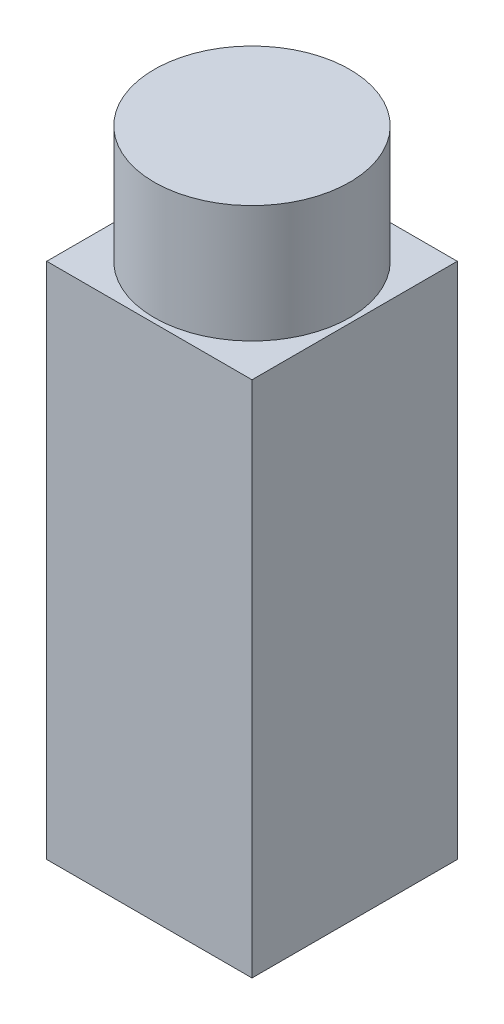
from build123d import *

# Parameters (mm, degrees)
SKIZZE2_W                       = 10.5
SKIZZE2_H                       = 10.5
AUFSATZ_LINEAR_AUSTRAGEN1_DEPTH = 26.5
SKIZZE3_W                       = 6.5
SKIZZE3_H                       = 6.5
SCHNITT_LINEAR_AUSTRAGEN1_DEPTH = 3
SKIZZE4_R                       = 5
AUFSATZ_LINEAR_AUSTRAGEN2_DEPTH = 6


with BuildPart() as part:
    # Skizze2 → Aufsatz-Linear austragen1 (new body)
    with BuildSketch(Plane(origin=(0, 0, 0), x_dir=(1, 0, 0), z_dir=(0, 1, 0))):
        with Locations((3.25, -3.25)):
            Rectangle(SKIZZE2_W, SKIZZE2_H)
    extrude(amount=AUFSATZ_LINEAR_AUSTRAGEN1_DEPTH)

    # Skizze3 → Schnitt-Linear austragen1 (cut)
    with BuildSketch(Plane(origin=(0, 0, 0), x_dir=(-1, 0, 0), z_dir=(0, -1, 0))):
        with Locations((-3.25, -3.25)):
            Rectangle(SKIZZE3_W, SKIZZE3_H)
    extrude(amount=-SCHNITT_LINEAR_AUSTRAGEN1_DEPTH, mode=Mode.SUBTRACT)

    # Skizze4 → Aufsatz-Linear austragen2 (add)
    with BuildSketch(Plane(origin=(0, 26.5, 0), x_dir=(1, 0, 0), z_dir=(0, 1, 0))):
        with Locations(Location((3.25, -3.25, 0), (0, 0, 270))):
            Circle(SKIZZE4_R)
    extrude(amount=AUFSATZ_LINEAR_AUSTRAGEN2_DEPTH)


solid = part.part
